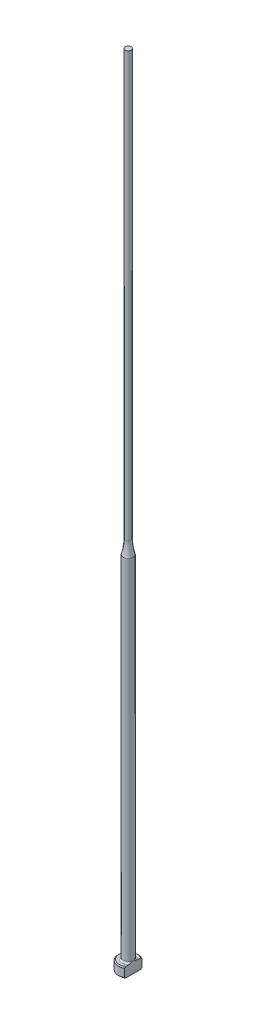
from build123d import *
from build123d.topology import SkipClean

# Parameters (mm, degrees)
CHAMFER1_SIZE = 0.2
FILLET1_R     = 0.3
KEY_DEPTH     = 161.024998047


with BuildPart() as part:
    # Sketch1 → Revolve1 (revolve)
    with BuildSketch(Plane.XY, mode=Mode.PRIVATE) as revolve1_sk:
        with BuildLine():
            Line((0, 0), (-2, 0))
            Line((-2, 0), (-2, 2))
            Line((-2, 2), (-1, 2))
            Line((-1, 2), (-1, 72.2))
            ThreePointArc((-1, 72.2), (-0.700505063, 73.585786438), (-0.6, 75))
            Line((-0.6, 75), (-0.6, 160))
            Line((-0.6, 160), (0, 160))
            Line((0, 160), (0, 0))
        make_face()
    revolve(revolve1_sk.sketch.rotate(Axis((0, 259.958771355, 0), (0, -1, 0)), 270), axis=Axis((0, 259.958771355, 0), (0, -1, 0)))

    # Chamfer1
    chamfer1_edges = [part.edges().sort_by_distance(p)[0] for p in [
        (0, 0, -2),
        (0, 2, -2),
    ]]
    chamfer(chamfer1_edges, length=CHAMFER1_SIZE)

    # Fillet1
    fillet1_edges = [part.edges().sort_by_distance(p)[0] for p in [
        (0, 2, -1),
    ]]
    fillet(fillet1_edges, radius=FILLET1_R)

    # Sketch2 → KEY (cut, through all)
    with SkipClean():  # the faces are left unmerged after this step: merging them gives an invalid solid
        with BuildSketch(Plane(origin=(0, 0, 0), x_dir=(1, 0, 0), z_dir=(0, 1, 0))):
            with BuildLine():
                Line((1, 1.732050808), (1, -1.732050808))
                ThreePointArc((1, -1.732050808), (2, 0), (1, 1.732050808))
            make_face()
        extrude(amount=KEY_DEPTH, mode=Mode.SUBTRACT)


solid = part.part
